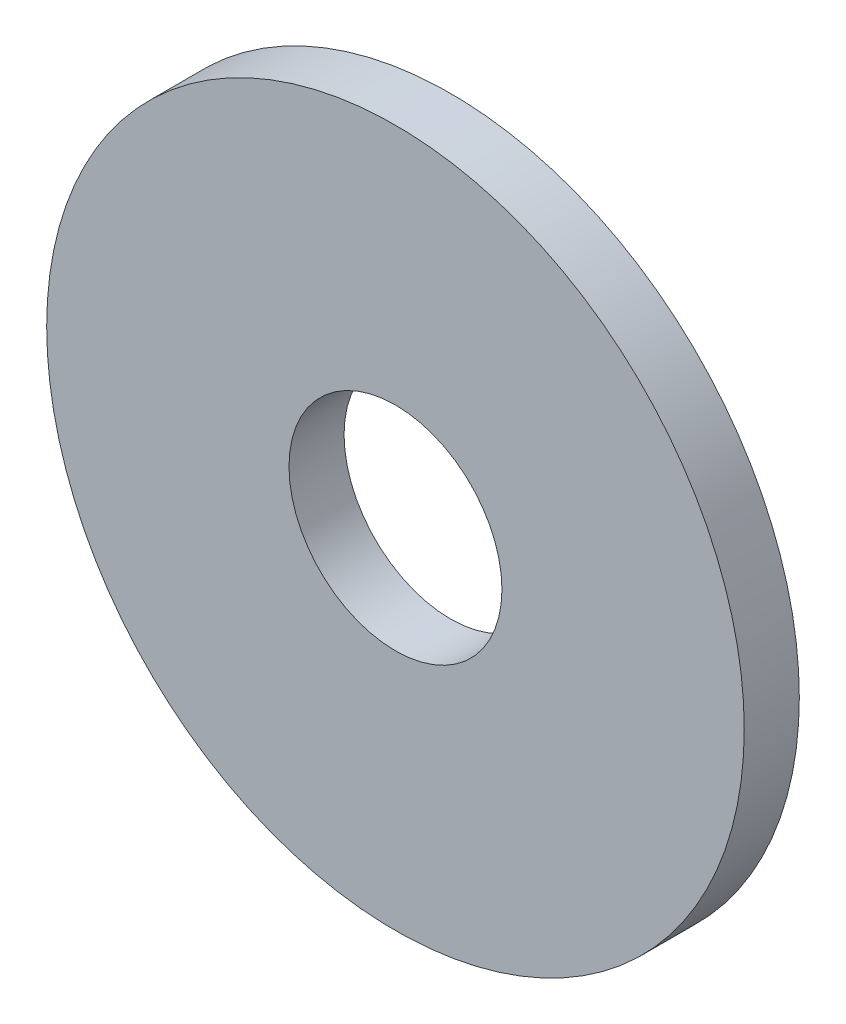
ISO-10303-21;
HEADER;
FILE_DESCRIPTION(('STEP AP214'),'2;1');
FILE_NAME('part.step','',(''),(''),'','','');
FILE_SCHEMA(('AUTOMOTIVE_DESIGN { 1 0 10303 214 1 1 1 1 }'));
ENDSEC;
DATA;
#1=APPLICATION_CONTEXT('core data for automotive mechanical design processes');
#2=APPLICATION_PROTOCOL_DEFINITION('international standard','automotive_design',2000,#1);
#3=PRODUCT_CONTEXT('',#1,'mechanical');
#4=PRODUCT('Part','Part','',(#3));
#5=PRODUCT_RELATED_PRODUCT_CATEGORY('part','',(#4));
#6=PRODUCT_DEFINITION_FORMATION('','',#4);
#7=PRODUCT_DEFINITION_CONTEXT('part definition',#1,'design');
#8=PRODUCT_DEFINITION('design','',#6,#7);
#9=PRODUCT_DEFINITION_SHAPE('','',#8);
#10=(LENGTH_UNIT() NAMED_UNIT(*) SI_UNIT(.MILLI.,.METRE.));
#11=(NAMED_UNIT(*) PLANE_ANGLE_UNIT() SI_UNIT($,.RADIAN.));
#12=(NAMED_UNIT(*) SI_UNIT($,.STERADIAN.) SOLID_ANGLE_UNIT());
#13=UNCERTAINTY_MEASURE_WITH_UNIT(LENGTH_MEASURE(1.E-05),#10,'distance_accuracy_value','');
#14=(GEOMETRIC_REPRESENTATION_CONTEXT(3) GLOBAL_UNCERTAINTY_ASSIGNED_CONTEXT((#13)) GLOBAL_UNIT_ASSIGNED_CONTEXT((#10,
#11,#12)) REPRESENTATION_CONTEXT('',''));
#15=CARTESIAN_POINT('',(0.,0.,0.));
#16=DIRECTION('',(0.,0.,1.));
#17=DIRECTION('',(1.,0.,0.));
#18=AXIS2_PLACEMENT_3D('',#15,#16,#17);
#19=CARTESIAN_POINT('',(0.,0.,0.762));
#20=DIRECTION('',(0.,0.,-1.));
#21=DIRECTION('',(-1.,0.,0.));
#22=AXIS2_PLACEMENT_3D('',#19,#20,#21);
#23=CYLINDRICAL_SURFACE('',#22,4.826);
#24=CARTESIAN_POINT('',(0.,0.,0.762));
#25=DIRECTION('',(0.,0.,1.));
#26=DIRECTION('',(1.,0.,0.));
#27=AXIS2_PLACEMENT_3D('',#24,#25,#26);
#28=CIRCLE('',#27,4.826);
#29=CARTESIAN_POINT('',(-4.826,0.,0.762));
#30=VERTEX_POINT('',#29);
#31=EDGE_CURVE('E10',#30,#30,#28,.T.);
#32=CARTESIAN_POINT('',(0.,0.,0.));
#33=DIRECTION('',(0.,0.,1.));
#34=DIRECTION('',(1.,0.,0.));
#35=AXIS2_PLACEMENT_3D('',#32,#33,#34);
#36=CIRCLE('',#35,4.826);
#37=CARTESIAN_POINT('',(-4.826,0.,0.));
#38=VERTEX_POINT('',#37);
#39=EDGE_CURVE('E33',#38,#38,#36,.T.);
#40=CARTESIAN_POINT('',(-4.826,0.,0.762));
#41=CARTESIAN_POINT('',(-4.826,0.,0.7540625));
#42=CARTESIAN_POINT('',(-4.826,0.,0.746125));
#43=CARTESIAN_POINT('',(-4.826,0.,0.73025));
#44=CARTESIAN_POINT('',(-4.826,0.,0.7223125));
#45=CARTESIAN_POINT('',(-4.826,0.,0.7064375));
#46=CARTESIAN_POINT('',(-4.826,0.,0.6985));
#47=CARTESIAN_POINT('',(-4.826,0.,0.682625));
#48=CARTESIAN_POINT('',(-4.826,0.,0.6746875));
#49=CARTESIAN_POINT('',(-4.826,0.,0.6588125));
#50=CARTESIAN_POINT('',(-4.826,0.,0.650875));
#51=CARTESIAN_POINT('',(-4.826,0.,0.635));
#52=CARTESIAN_POINT('',(-4.826,0.,0.6270625));
#53=CARTESIAN_POINT('',(-4.826,0.,0.6111875));
#54=CARTESIAN_POINT('',(-4.826,0.,0.60325));
#55=CARTESIAN_POINT('',(-4.826,0.,0.587375));
#56=CARTESIAN_POINT('',(-4.826,0.,0.5794375));
#57=CARTESIAN_POINT('',(-4.826,0.,0.5635625));
#58=CARTESIAN_POINT('',(-4.826,0.,0.555625));
#59=CARTESIAN_POINT('',(-4.826,0.,0.53975));
#60=CARTESIAN_POINT('',(-4.826,0.,0.5318125));
#61=CARTESIAN_POINT('',(-4.826,0.,0.5159375));
#62=CARTESIAN_POINT('',(-4.826,0.,0.508));
#63=CARTESIAN_POINT('',(-4.826,0.,0.492125));
#64=CARTESIAN_POINT('',(-4.826,0.,0.4841875));
#65=CARTESIAN_POINT('',(-4.826,0.,0.4683125));
#66=CARTESIAN_POINT('',(-4.826,0.,0.460375));
#67=CARTESIAN_POINT('',(-4.826,0.,0.4445));
#68=CARTESIAN_POINT('',(-4.826,0.,0.4365625));
#69=CARTESIAN_POINT('',(-4.826,0.,0.4206875));
#70=CARTESIAN_POINT('',(-4.826,0.,0.41275));
#71=CARTESIAN_POINT('',(-4.826,0.,0.396875));
#72=CARTESIAN_POINT('',(-4.826,0.,0.3889375));
#73=CARTESIAN_POINT('',(-4.826,0.,0.3730625));
#74=CARTESIAN_POINT('',(-4.826,0.,0.365125));
#75=CARTESIAN_POINT('',(-4.826,0.,0.34925));
#76=CARTESIAN_POINT('',(-4.826,0.,0.3413125));
#77=CARTESIAN_POINT('',(-4.826,0.,0.3254375));
#78=CARTESIAN_POINT('',(-4.826,0.,0.3175));
#79=CARTESIAN_POINT('',(-4.826,0.,0.301625));
#80=CARTESIAN_POINT('',(-4.826,0.,0.2936875));
#81=CARTESIAN_POINT('',(-4.826,0.,0.2778125));
#82=CARTESIAN_POINT('',(-4.826,0.,0.269875));
#83=CARTESIAN_POINT('',(-4.826,0.,0.254));
#84=CARTESIAN_POINT('',(-4.826,0.,0.2460625));
#85=CARTESIAN_POINT('',(-4.826,0.,0.2301875));
#86=CARTESIAN_POINT('',(-4.826,0.,0.22225));
#87=CARTESIAN_POINT('',(-4.826,0.,0.206375));
#88=CARTESIAN_POINT('',(-4.826,0.,0.1984375));
#89=CARTESIAN_POINT('',(-4.826,0.,0.1825625));
#90=CARTESIAN_POINT('',(-4.826,0.,0.174625));
#91=CARTESIAN_POINT('',(-4.826,0.,0.15875));
#92=CARTESIAN_POINT('',(-4.826,0.,0.1508125));
#93=CARTESIAN_POINT('',(-4.826,0.,0.1349375));
#94=CARTESIAN_POINT('',(-4.826,0.,0.127));
#95=CARTESIAN_POINT('',(-4.826,0.,0.111125));
#96=CARTESIAN_POINT('',(-4.826,0.,0.1031875));
#97=CARTESIAN_POINT('',(-4.826,0.,0.0873125));
#98=CARTESIAN_POINT('',(-4.826,0.,0.079375));
#99=CARTESIAN_POINT('',(-4.826,0.,0.0635));
#100=CARTESIAN_POINT('',(-4.826,0.,0.0555625));
#101=CARTESIAN_POINT('',(-4.826,0.,0.0396875));
#102=CARTESIAN_POINT('',(-4.826,0.,0.03175));
#103=CARTESIAN_POINT('',(-4.826,0.,0.015875));
#104=CARTESIAN_POINT('',(-4.826,0.,0.00793749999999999));
#105=CARTESIAN_POINT('',(-4.826,0.,0.));
#106=B_SPLINE_CURVE_WITH_KNOTS('',3,(#40,#41,#42,#43,#44,#45,#46,#47,#48,#49,#50,#51,#52,#53,
#54,#55,#56,#57,#58,#59,#60,#61,#62,#63,#64,#65,#66,#67,#68,#69,#70,#71,#72,#73,#74,#75,#76,#77,
#78,#79,#80,#81,#82,#83,#84,#85,#86,#87,#88,#89,#90,#91,#92,#93,#94,#95,#96,#97,#98,#99,#100,
#101,#102,#103,#104,#105),.UNSPECIFIED.,.F.,.F.,(4,2,2,2,2,2,2,2,2,2,2,2,2,2,2,2,2,2,2,2,2,2,2,
2,2,2,2,2,2,2,2,2,4),(0.,0.0238125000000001,0.047625,0.0714375,0.0952500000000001,0.1190625,
0.142875,0.1666875,0.1905,0.2143125,0.238125,0.2619375,0.28575,0.3095625,0.333375,0.3571875,
0.381,0.4048125,0.428625,0.4524375,0.47625,0.5000625,0.523875,0.5476875,0.5715,0.5953125,
0.619125,0.6429375,0.66675,0.6905625,0.714375,0.7381875,0.762),.UNSPECIFIED.);
#107=EDGE_CURVE('BSEAM30',#30,#38,#106,.T.);
#108=ORIENTED_EDGE('',*,*,#31,.F.);
#109=ORIENTED_EDGE('',*,*,#39,.T.);
#110=ORIENTED_EDGE('',*,*,#107,.T.);
#111=ORIENTED_EDGE('',*,*,#107,.F.);
#112=EDGE_LOOP('',(#108,#110,#109,#111));
#113=FACE_BOUND('',#112,.T.);
#114=ADVANCED_FACE('F30',(#113),#23,.T.);
#115=CARTESIAN_POINT('',(0.,0.,0.762));
#116=DIRECTION('',(0.,0.,1.));
#117=DIRECTION('',(1.,0.,0.));
#118=AXIS2_PLACEMENT_3D('',#115,#116,#117);
#119=PLANE('',#118);
#120=CARTESIAN_POINT('',(0.,0.,0.762000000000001));
#121=DIRECTION('',(0.,0.,1.));
#122=DIRECTION('',(1.,0.,0.));
#123=AXIS2_PLACEMENT_3D('',#120,#121,#122);
#124=CIRCLE('',#123,1.47319999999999);
#125=CARTESIAN_POINT('',(1.47319999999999,0.,0.762000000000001));
#126=VERTEX_POINT('',#125);
#127=EDGE_CURVE('E44',#126,#126,#124,.T.);
#128=ORIENTED_EDGE('',*,*,#127,.F.);
#129=EDGE_LOOP('',(#128));
#130=FACE_BOUND('',#129,.T.);
#131=ORIENTED_EDGE('',*,*,#31,.T.);
#132=EDGE_LOOP('',(#131));
#133=FACE_BOUND('',#132,.T.);
#134=ADVANCED_FACE('F50',(#130,#133),#119,.T.);
#135=CARTESIAN_POINT('',(0.,0.,0.));
#136=DIRECTION('',(0.,0.,1.));
#137=DIRECTION('',(1.,0.,0.));
#138=AXIS2_PLACEMENT_3D('',#135,#136,#137);
#139=PLANE('',#138);
#140=CARTESIAN_POINT('',(0.,0.,0.));
#141=DIRECTION('',(0.,0.,1.));
#142=DIRECTION('',(1.,0.,0.));
#143=AXIS2_PLACEMENT_3D('',#140,#141,#142);
#144=CIRCLE('',#143,1.4732);
#145=CARTESIAN_POINT('',(1.4732,0.,0.));
#146=VERTEX_POINT('',#145);
#147=EDGE_CURVE('E40',#146,#146,#144,.T.);
#148=ORIENTED_EDGE('',*,*,#147,.T.);
#149=EDGE_LOOP('',(#148));
#150=FACE_BOUND('',#149,.T.);
#151=ORIENTED_EDGE('',*,*,#39,.F.);
#152=EDGE_LOOP('',(#151));
#153=FACE_BOUND('',#152,.T.);
#154=ADVANCED_FACE('F52',(#150,#153),#139,.F.);
#155=CARTESIAN_POINT('',(0.,0.,0.762));
#156=DIRECTION('',(0.,0.,1.));
#157=DIRECTION('',(1.,0.,0.));
#158=AXIS2_PLACEMENT_3D('',#155,#156,#157);
#159=CYLINDRICAL_SURFACE('',#158,1.47319999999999);
#160=ORIENTED_EDGE('',*,*,#147,.F.);
#161=EDGE_LOOP('',(#160));
#162=FACE_BOUND('',#161,.T.);
#163=ORIENTED_EDGE('',*,*,#127,.T.);
#164=EDGE_LOOP('',(#163));
#165=FACE_BOUND('',#164,.T.);
#166=ADVANCED_FACE('F48',(#162,#165),#159,.F.);
#167=CLOSED_SHELL('',(#114,#134,#154,#166));
#168=MANIFOLD_SOLID_BREP('B2',#167);
#169=ADVANCED_BREP_SHAPE_REPRESENTATION('',(#18,#168),#14);
#170=SHAPE_DEFINITION_REPRESENTATION(#9,#169);
ENDSEC;
END-ISO-10303-21;
